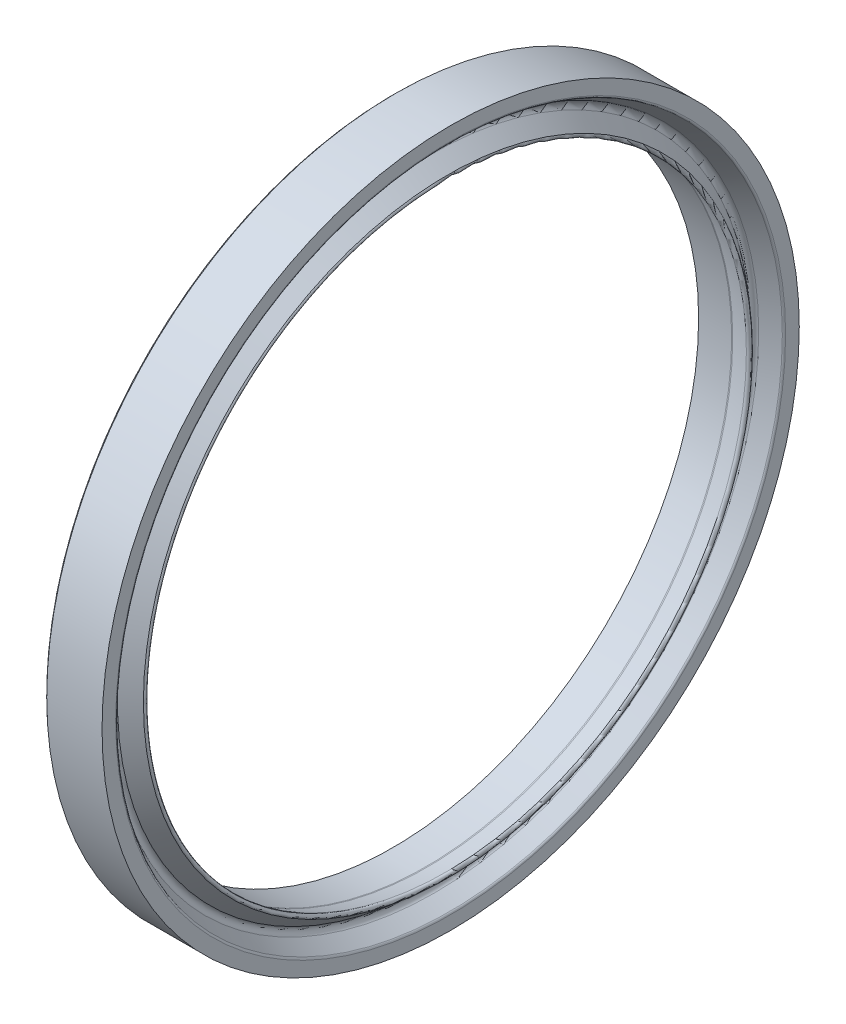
from build123d import *


with BuildPart() as part:
    # Esquisse1 → Base-R_volution (revolve)
    with BuildSketch(Plane(origin=(0, 0, 0), x_dir=(-1, 0, 0), z_dir=(0, 0, 1)), mode=Mode.PRIVATE) as base_r_volution_sk:
        with BuildLine():
            Line((4.6, 29), (4.8, 28.8))
            Line((4.8, 28.8), (4.8, 25.428718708))
            Line((4.8, 25.428718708), (2.052660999, 25.428718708))
            ThreePointArc((2.052660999, 25.428718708), (2.000450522, 25.425296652), (1.949133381, 25.415089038))
            Line((1.949133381, 25.415089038), (0.4, 25))
            ThreePointArc((0.4, 25), (0.180716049, 25.096487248), (0.22745443, 25.331456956))
            Line((0.22745443, 25.331456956), (1.402993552, 26.3178514))
            ThreePointArc((1.402993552, 26.3178514), (1.544356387, 26.659131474), (1.345878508, 26.970679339))
            Line((1.345878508, 26.970679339), (0.1, 27.689987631))
            ThreePointArc((0.1, 27.689987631), (0.026794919, 27.763192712), (0, 27.863192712))
            Line((0, 27.863192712), (0, 29))
            Line((0, 29), (4.6, 29))
        make_face()
    revolve(base_r_volution_sk.sketch.rotate(Axis((2.43404063, 0, 0), (-1, 0, 0)), 270), axis=Axis((2.43404063, 0, 0), (-1, 0, 0)))


solid = part.part
